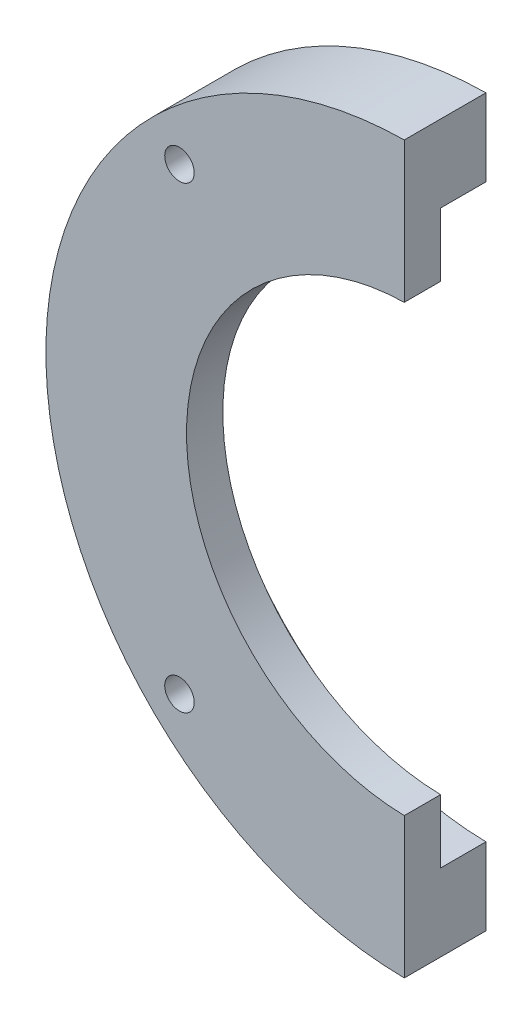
ISO-10303-21;
HEADER;
FILE_DESCRIPTION(('STEP AP214'),'2;1');
FILE_NAME('part.step','',(''),(''),'','','');
FILE_SCHEMA(('AUTOMOTIVE_DESIGN { 1 0 10303 214 1 1 1 1 }'));
ENDSEC;
DATA;
#1=APPLICATION_CONTEXT('core data for automotive mechanical design processes');
#2=APPLICATION_PROTOCOL_DEFINITION('international standard','automotive_design',2000,#1);
#3=PRODUCT_CONTEXT('',#1,'mechanical');
#4=PRODUCT('Part','Part','',(#3));
#5=PRODUCT_RELATED_PRODUCT_CATEGORY('part','',(#4));
#6=PRODUCT_DEFINITION_FORMATION('','',#4);
#7=PRODUCT_DEFINITION_CONTEXT('part definition',#1,'design');
#8=PRODUCT_DEFINITION('design','',#6,#7);
#9=PRODUCT_DEFINITION_SHAPE('','',#8);
#10=(LENGTH_UNIT() NAMED_UNIT(*) SI_UNIT(.MILLI.,.METRE.));
#11=(NAMED_UNIT(*) PLANE_ANGLE_UNIT() SI_UNIT($,.RADIAN.));
#12=(NAMED_UNIT(*) SI_UNIT($,.STERADIAN.) SOLID_ANGLE_UNIT());
#13=UNCERTAINTY_MEASURE_WITH_UNIT(LENGTH_MEASURE(1.E-05),#10,'distance_accuracy_value','');
#14=(GEOMETRIC_REPRESENTATION_CONTEXT(3) GLOBAL_UNCERTAINTY_ASSIGNED_CONTEXT((#13)) GLOBAL_UNIT_ASSIGNED_CONTEXT((#10,
#11,#12)) REPRESENTATION_CONTEXT('',''));
#15=CARTESIAN_POINT('',(0.,0.,0.));
#16=DIRECTION('',(0.,0.,1.));
#17=DIRECTION('',(1.,0.,0.));
#18=AXIS2_PLACEMENT_3D('',#15,#16,#17);
#19=CARTESIAN_POINT('',(0.,0.,18.));
#20=DIRECTION('',(0.,0.,-1.));
#21=DIRECTION('',(-1.,0.,0.));
#22=AXIS2_PLACEMENT_3D('',#19,#20,#21);
#23=CYLINDRICAL_SURFACE('',#22,80.);
#24=CARTESIAN_POINT('',(0.,0.,18.));
#25=DIRECTION('',(0.,0.,1.));
#26=DIRECTION('',(1.,0.,0.));
#27=AXIS2_PLACEMENT_3D('',#24,#25,#26);
#28=CIRCLE('',#27,80.);
#29=CARTESIAN_POINT('',(-1.,79.9937497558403,18.));
#30=VERTEX_POINT('',#29);
#31=CARTESIAN_POINT('',(-1.,-79.9937497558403,18.));
#32=VERTEX_POINT('',#31);
#33=EDGE_CURVE('E109',#30,#32,#28,.T.);
#34=ORIENTED_EDGE('',*,*,#33,.F.);
#35=DIRECTION('',(0.,0.,-1.));
#36=VECTOR('',#35,1.);
#37=CARTESIAN_POINT('',(-1.,79.9937497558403,18.));
#38=LINE('',#37,#36);
#39=CARTESIAN_POINT('',(-1.,79.9937497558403,0.));
#40=VERTEX_POINT('',#39);
#41=EDGE_CURVE('E96',#30,#40,#38,.T.);
#42=ORIENTED_EDGE('',*,*,#41,.T.);
#43=CARTESIAN_POINT('',(0.,0.,0.));
#44=DIRECTION('',(0.,0.,1.));
#45=DIRECTION('',(1.,0.,0.));
#46=AXIS2_PLACEMENT_3D('',#43,#44,#45);
#47=CIRCLE('',#46,80.);
#48=CARTESIAN_POINT('',(-1.,-79.9937497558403,0.));
#49=VERTEX_POINT('',#48);
#50=EDGE_CURVE('E103',#40,#49,#47,.T.);
#51=ORIENTED_EDGE('',*,*,#50,.T.);
#52=DIRECTION('',(0.,0.,-1.));
#53=VECTOR('',#52,1.);
#54=CARTESIAN_POINT('',(-1.,-79.9937497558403,18.));
#55=LINE('',#54,#53);
#56=EDGE_CURVE('E85',#32,#49,#55,.T.);
#57=ORIENTED_EDGE('',*,*,#56,.F.);
#58=EDGE_LOOP('',(#34,#42,#51,#57));
#59=FACE_BOUND('',#58,.T.);
#60=ADVANCED_FACE('F36',(#59),#23,.T.);
#61=CARTESIAN_POINT('',(0.,0.,18.));
#62=DIRECTION('',(0.,0.,1.));
#63=DIRECTION('',(1.,0.,0.));
#64=AXIS2_PLACEMENT_3D('',#61,#62,#63);
#65=PLANE('',#64);
#66=DIRECTION('',(0.,1.,0.));
#67=VECTOR('',#66,1.);
#68=CARTESIAN_POINT('',(-1.,-79.9937497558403,18.));
#69=LINE('',#68,#67);
#70=CARTESIAN_POINT('',(-1.,48.9897948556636,18.));
#71=VERTEX_POINT('',#70);
#72=EDGE_CURVE('E58',#71,#30,#69,.T.);
#73=ORIENTED_EDGE('',*,*,#72,.T.);
#74=ORIENTED_EDGE('',*,*,#33,.T.);
#75=CARTESIAN_POINT('',(-1.,-48.9897948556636,18.));
#76=VERTEX_POINT('',#75);
#77=EDGE_CURVE('E91',#32,#76,#69,.T.);
#78=ORIENTED_EDGE('',*,*,#77,.T.);
#79=CARTESIAN_POINT('',(0.,0.,18.));
#80=DIRECTION('',(0.,0.,-1.));
#81=DIRECTION('',(-1.,0.,0.));
#82=AXIS2_PLACEMENT_3D('',#79,#80,#81);
#83=CIRCLE('',#82,49.);
#84=EDGE_CURVE('E123',#76,#71,#83,.T.);
#85=ORIENTED_EDGE('',*,*,#84,.T.);
#86=EDGE_LOOP('',(#73,#74,#78,#85));
#87=FACE_BOUND('',#86,.T.);
#88=CARTESIAN_POINT('',(-50.558134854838,50.5581348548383,18.));
#89=DIRECTION('',(0.,0.,1.));
#90=DIRECTION('',(0.,-1.,0.));
#91=AXIS2_PLACEMENT_3D('',#88,#89,#90);
#92=CIRCLE('',#91,3.25);
#93=CARTESIAN_POINT('',(-50.558134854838,47.3081348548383,18.));
#94=VERTEX_POINT('',#93);
#95=EDGE_CURVE('E149',#94,#94,#92,.T.);
#96=ORIENTED_EDGE('',*,*,#95,.F.);
#97=EDGE_LOOP('',(#96));
#98=FACE_BOUND('',#97,.T.);
#99=CARTESIAN_POINT('',(-50.5581348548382,-50.5581348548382,18.));
#100=DIRECTION('',(0.,0.,1.));
#101=DIRECTION('',(1.,0.,0.));
#102=AXIS2_PLACEMENT_3D('',#99,#100,#101);
#103=CIRCLE('',#102,3.25);
#104=CARTESIAN_POINT('',(-47.3081348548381,-50.5581348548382,18.));
#105=VERTEX_POINT('',#104);
#106=EDGE_CURVE('E134',#105,#105,#103,.T.);
#107=ORIENTED_EDGE('',*,*,#106,.F.);
#108=EDGE_LOOP('',(#107));
#109=FACE_BOUND('',#108,.T.);
#110=ADVANCED_FACE('F156',(#87,#98,#109),#65,.T.);
#111=CARTESIAN_POINT('',(0.,0.,0.));
#112=DIRECTION('',(0.,0.,1.));
#113=DIRECTION('',(1.,0.,0.));
#114=AXIS2_PLACEMENT_3D('',#111,#112,#113);
#115=PLANE('',#114);
#116=CARTESIAN_POINT('',(-50.558134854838,50.5581348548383,0.));
#117=DIRECTION('',(0.,0.,1.));
#118=DIRECTION('',(0.,-1.,0.));
#119=AXIS2_PLACEMENT_3D('',#116,#117,#118);
#120=CIRCLE('',#119,3.25);
#121=CARTESIAN_POINT('',(-50.558134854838,47.3081348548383,0.));
#122=VERTEX_POINT('',#121);
#123=EDGE_CURVE('E146',#122,#122,#120,.T.);
#124=ORIENTED_EDGE('',*,*,#123,.T.);
#125=EDGE_LOOP('',(#124));
#126=FACE_BOUND('',#125,.T.);
#127=CARTESIAN_POINT('',(-50.5581348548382,-50.5581348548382,0.));
#128=DIRECTION('',(0.,0.,1.));
#129=DIRECTION('',(1.,0.,0.));
#130=AXIS2_PLACEMENT_3D('',#127,#128,#129);
#131=CIRCLE('',#130,3.25);
#132=CARTESIAN_POINT('',(-47.3081348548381,-50.5581348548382,0.));
#133=VERTEX_POINT('',#132);
#134=EDGE_CURVE('E129',#133,#133,#131,.T.);
#135=ORIENTED_EDGE('',*,*,#134,.T.);
#136=EDGE_LOOP('',(#135));
#137=FACE_BOUND('',#136,.T.);
#138=ORIENTED_EDGE('',*,*,#50,.F.);
#139=DIRECTION('',(0.,1.,0.));
#140=VECTOR('',#139,1.);
#141=CARTESIAN_POINT('',(-1.,-79.9937497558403,0.));
#142=LINE('',#141,#140);
#143=CARTESIAN_POINT('',(-1.,62.9920629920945,0.));
#144=VERTEX_POINT('',#143);
#145=EDGE_CURVE('E106',#144,#40,#142,.T.);
#146=ORIENTED_EDGE('',*,*,#145,.F.);
#147=CARTESIAN_POINT('',(0.,0.,0.));
#148=DIRECTION('',(0.,0.,-1.));
#149=DIRECTION('',(-1.,0.,0.));
#150=AXIS2_PLACEMENT_3D('',#147,#148,#149);
#151=CIRCLE('',#150,63.);
#152=CARTESIAN_POINT('',(-1.,-62.9920629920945,0.));
#153=VERTEX_POINT('',#152);
#154=EDGE_CURVE('E105',#153,#144,#151,.T.);
#155=ORIENTED_EDGE('',*,*,#154,.F.);
#156=EDGE_CURVE('E88',#49,#153,#142,.T.);
#157=ORIENTED_EDGE('',*,*,#156,.F.);
#158=EDGE_LOOP('',(#138,#146,#155,#157));
#159=FACE_BOUND('',#158,.T.);
#160=ADVANCED_FACE('F101',(#126,#137,#159),#115,.F.);
#161=CARTESIAN_POINT('',(0.,0.,10.));
#162=DIRECTION('',(0.,0.,-1.));
#163=DIRECTION('',(-1.,0.,0.));
#164=AXIS2_PLACEMENT_3D('',#161,#162,#163);
#165=CYLINDRICAL_SURFACE('',#164,63.);
#166=ORIENTED_EDGE('',*,*,#154,.T.);
#167=DIRECTION('',(0.,0.,-1.));
#168=VECTOR('',#167,1.);
#169=CARTESIAN_POINT('',(-1.,62.9920629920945,10.));
#170=LINE('',#169,#168);
#171=CARTESIAN_POINT('',(-1.,62.9920629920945,10.));
#172=VERTEX_POINT('',#171);
#173=EDGE_CURVE('E140',#144,#172,#170,.F.);
#174=ORIENTED_EDGE('',*,*,#173,.T.);
#175=CARTESIAN_POINT('',(0.,0.,10.));
#176=DIRECTION('',(0.,0.,-1.));
#177=DIRECTION('',(-1.,0.,0.));
#178=AXIS2_PLACEMENT_3D('',#175,#176,#177);
#179=CIRCLE('',#178,63.);
#180=CARTESIAN_POINT('',(-1.,-62.9920629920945,10.));
#181=VERTEX_POINT('',#180);
#182=EDGE_CURVE('E110',#181,#172,#179,.T.);
#183=ORIENTED_EDGE('',*,*,#182,.F.);
#184=DIRECTION('',(0.,0.,-1.));
#185=VECTOR('',#184,1.);
#186=CARTESIAN_POINT('',(-1.,-62.9920629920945,10.));
#187=LINE('',#186,#185);
#188=EDGE_CURVE('E141',#181,#153,#187,.T.);
#189=ORIENTED_EDGE('',*,*,#188,.T.);
#190=EDGE_LOOP('',(#166,#174,#183,#189));
#191=FACE_BOUND('',#190,.T.);
#192=ADVANCED_FACE('F139',(#191),#165,.F.);
#193=CARTESIAN_POINT('',(0.,0.,10.));
#194=DIRECTION('',(0.,0.,-1.));
#195=DIRECTION('',(-1.,0.,0.));
#196=AXIS2_PLACEMENT_3D('',#193,#194,#195);
#197=PLANE('',#196);
#198=DIRECTION('',(0.,1.,0.));
#199=VECTOR('',#198,1.);
#200=CARTESIAN_POINT('',(-1.,0.,10.));
#201=LINE('',#200,#199);
#202=CARTESIAN_POINT('',(-1.,-48.9897948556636,10.));
#203=VERTEX_POINT('',#202);
#204=EDGE_CURVE('E50',#181,#203,#201,.T.);
#205=ORIENTED_EDGE('',*,*,#204,.F.);
#206=ORIENTED_EDGE('',*,*,#182,.T.);
#207=CARTESIAN_POINT('',(-1.,48.9897948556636,10.));
#208=VERTEX_POINT('',#207);
#209=EDGE_CURVE('E128',#208,#172,#201,.T.);
#210=ORIENTED_EDGE('',*,*,#209,.F.);
#211=CARTESIAN_POINT('',(0.,0.,10.));
#212=DIRECTION('',(0.,0.,-1.));
#213=DIRECTION('',(-1.,0.,0.));
#214=AXIS2_PLACEMENT_3D('',#211,#212,#213);
#215=CIRCLE('',#214,49.);
#216=EDGE_CURVE('E121',#203,#208,#215,.T.);
#217=ORIENTED_EDGE('',*,*,#216,.F.);
#218=EDGE_LOOP('',(#205,#206,#210,#217));
#219=FACE_BOUND('',#218,.T.);
#220=ADVANCED_FACE('F126',(#219),#197,.T.);
#221=CARTESIAN_POINT('',(0.,0.,18.));
#222=DIRECTION('',(0.,0.,-1.));
#223=DIRECTION('',(-1.,0.,0.));
#224=AXIS2_PLACEMENT_3D('',#221,#222,#223);
#225=CYLINDRICAL_SURFACE('',#224,49.);
#226=ORIENTED_EDGE('',*,*,#216,.T.);
#227=DIRECTION('',(0.,0.,-1.));
#228=VECTOR('',#227,1.);
#229=CARTESIAN_POINT('',(-1.,48.9897948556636,18.));
#230=LINE('',#229,#228);
#231=EDGE_CURVE('E11',#208,#71,#230,.F.);
#232=ORIENTED_EDGE('',*,*,#231,.T.);
#233=ORIENTED_EDGE('',*,*,#84,.F.);
#234=DIRECTION('',(0.,0.,-1.));
#235=VECTOR('',#234,1.);
#236=CARTESIAN_POINT('',(-1.,-48.9897948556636,18.));
#237=LINE('',#236,#235);
#238=EDGE_CURVE('E43',#76,#203,#237,.T.);
#239=ORIENTED_EDGE('',*,*,#238,.T.);
#240=EDGE_LOOP('',(#226,#232,#233,#239));
#241=FACE_BOUND('',#240,.T.);
#242=ADVANCED_FACE('F120',(#241),#225,.F.);
#243=CARTESIAN_POINT('',(-50.5581348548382,-50.5581348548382,0.));
#244=DIRECTION('',(0.,0.,1.));
#245=DIRECTION('',(1.,0.,0.));
#246=AXIS2_PLACEMENT_3D('',#243,#244,#245);
#247=CYLINDRICAL_SURFACE('',#246,3.25);
#248=ORIENTED_EDGE('',*,*,#134,.F.);
#249=EDGE_LOOP('',(#248));
#250=FACE_BOUND('',#249,.T.);
#251=ORIENTED_EDGE('',*,*,#106,.T.);
#252=EDGE_LOOP('',(#251));
#253=FACE_BOUND('',#252,.T.);
#254=ADVANCED_FACE('F154',(#250,#253),#247,.F.);
#255=CARTESIAN_POINT('',(-50.558134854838,50.5581348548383,0.));
#256=DIRECTION('',(0.,0.,1.));
#257=DIRECTION('',(0.,-1.,0.));
#258=AXIS2_PLACEMENT_3D('',#255,#256,#257);
#259=CYLINDRICAL_SURFACE('',#258,3.25);
#260=ORIENTED_EDGE('',*,*,#123,.F.);
#261=EDGE_LOOP('',(#260));
#262=FACE_BOUND('',#261,.T.);
#263=ORIENTED_EDGE('',*,*,#95,.T.);
#264=EDGE_LOOP('',(#263));
#265=FACE_BOUND('',#264,.T.);
#266=ADVANCED_FACE('F175',(#262,#265),#259,.F.);
#267=CARTESIAN_POINT('',(-1.,-79.9937497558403,18.));
#268=DIRECTION('',(-1.,0.,0.));
#269=DIRECTION('',(0.,0.,1.));
#270=AXIS2_PLACEMENT_3D('',#267,#268,#269);
#271=PLANE('',#270);
#272=ORIENTED_EDGE('',*,*,#204,.T.);
#273=ORIENTED_EDGE('',*,*,#238,.F.);
#274=ORIENTED_EDGE('',*,*,#77,.F.);
#275=ORIENTED_EDGE('',*,*,#56,.T.);
#276=ORIENTED_EDGE('',*,*,#156,.T.);
#277=ORIENTED_EDGE('',*,*,#188,.F.);
#278=EDGE_LOOP('',(#272,#273,#274,#275,#276,#277));
#279=FACE_BOUND('',#278,.T.);
#280=ADVANCED_FACE('F87',(#279),#271,.F.);
#281=ORIENTED_EDGE('',*,*,#145,.T.);
#282=ORIENTED_EDGE('',*,*,#41,.F.);
#283=ORIENTED_EDGE('',*,*,#72,.F.);
#284=ORIENTED_EDGE('',*,*,#231,.F.);
#285=ORIENTED_EDGE('',*,*,#209,.T.);
#286=ORIENTED_EDGE('',*,*,#173,.F.);
#287=EDGE_LOOP('',(#281,#282,#283,#284,#285,#286));
#288=FACE_BOUND('',#287,.T.);
#289=ADVANCED_FACE('F180',(#288),#271,.F.);
#290=CLOSED_SHELL('',(#60,#110,#160,#192,#220,#242,#254,#266,#280,#289));
#291=MANIFOLD_SOLID_BREP('B2',#290);
#292=ADVANCED_BREP_SHAPE_REPRESENTATION('',(#18,#291),#14);
#293=SHAPE_DEFINITION_REPRESENTATION(#9,#292);
ENDSEC;
END-ISO-10303-21;
